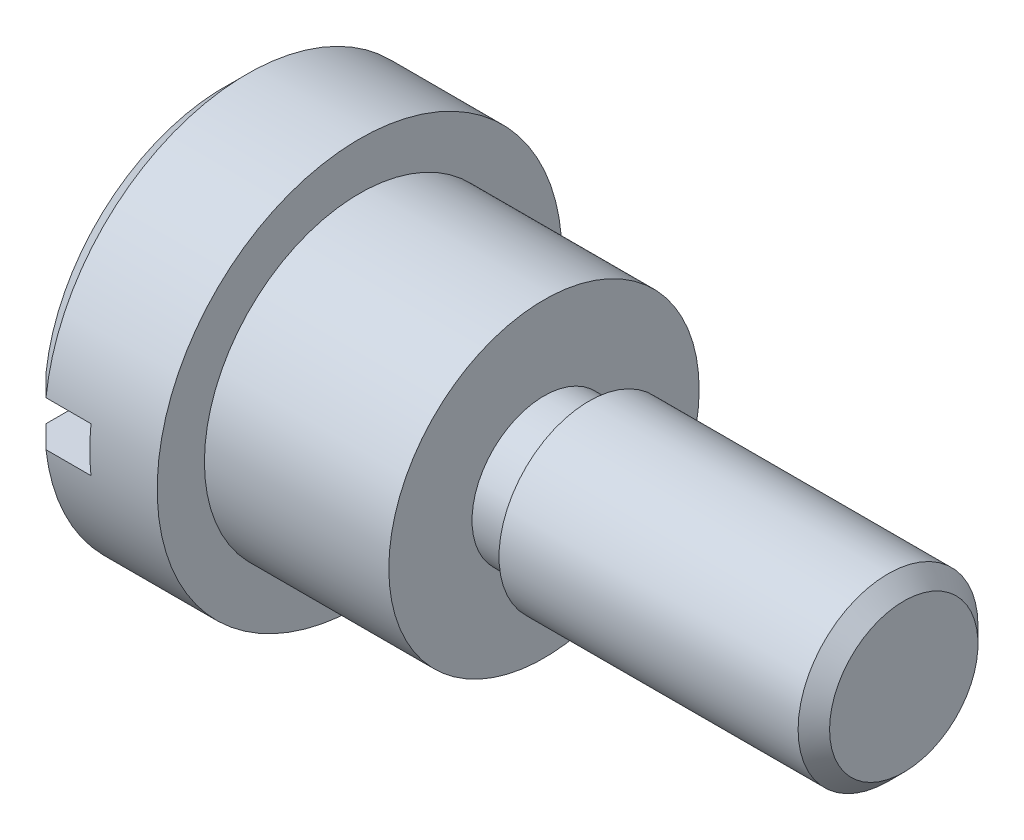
ISO-10303-21;
HEADER;
FILE_DESCRIPTION(('STEP AP214'),'2;1');
FILE_NAME('part.step','',(''),(''),'','','');
FILE_SCHEMA(('AUTOMOTIVE_DESIGN { 1 0 10303 214 1 1 1 1 }'));
ENDSEC;
DATA;
#1=APPLICATION_CONTEXT('core data for automotive mechanical design processes');
#2=APPLICATION_PROTOCOL_DEFINITION('international standard','automotive_design',2000,#1);
#3=PRODUCT_CONTEXT('',#1,'mechanical');
#4=PRODUCT('Part','Part','',(#3));
#5=PRODUCT_RELATED_PRODUCT_CATEGORY('part','',(#4));
#6=PRODUCT_DEFINITION_FORMATION('','',#4);
#7=PRODUCT_DEFINITION_CONTEXT('part definition',#1,'design');
#8=PRODUCT_DEFINITION('design','',#6,#7);
#9=PRODUCT_DEFINITION_SHAPE('','',#8);
#10=(LENGTH_UNIT() NAMED_UNIT(*) SI_UNIT(.MILLI.,.METRE.));
#11=(NAMED_UNIT(*) PLANE_ANGLE_UNIT() SI_UNIT($,.RADIAN.));
#12=(NAMED_UNIT(*) SI_UNIT($,.STERADIAN.) SOLID_ANGLE_UNIT());
#13=UNCERTAINTY_MEASURE_WITH_UNIT(LENGTH_MEASURE(1.E-05),#10,'distance_accuracy_value','');
#14=(GEOMETRIC_REPRESENTATION_CONTEXT(3) GLOBAL_UNCERTAINTY_ASSIGNED_CONTEXT((#13)) GLOBAL_UNIT_ASSIGNED_CONTEXT((#10,
#11,#12)) REPRESENTATION_CONTEXT('',''));
#15=CARTESIAN_POINT('',(0.,0.,0.));
#16=DIRECTION('',(0.,0.,1.));
#17=DIRECTION('',(1.,0.,0.));
#18=AXIS2_PLACEMENT_3D('',#15,#16,#17);
#19=CARTESIAN_POINT('',(15.1,0.825,0.));
#20=DIRECTION('',(1.,0.,0.));
#21=DIRECTION('',(0.,0.,-1.));
#22=AXIS2_PLACEMENT_3D('',#19,#20,#21);
#23=PLANE('',#22);
#24=CARTESIAN_POINT('',(15.1000000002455,0.,0.));
#25=DIRECTION('',(-1.,0.,0.));
#26=DIRECTION('',(0.,0.,1.));
#27=AXIS2_PLACEMENT_3D('',#24,#25,#26);
#28=CIRCLE('',#27,1.65000000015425);
#29=CARTESIAN_POINT('',(15.1000000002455,0.,1.65000000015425));
#30=VERTEX_POINT('',#29);
#31=EDGE_CURVE('E135',#30,#30,#28,.T.);
#32=ORIENTED_EDGE('',*,*,#31,.F.);
#33=EDGE_LOOP('',(#32));
#34=FACE_BOUND('',#33,.T.);
#35=ADVANCED_FACE('F17',(#34),#23,.T.);
#36=CARTESIAN_POINT('',(1.5,0.5,0.));
#37=DIRECTION('',(1.,0.,0.));
#38=DIRECTION('',(0.,0.,-1.));
#39=AXIS2_PLACEMENT_3D('',#36,#37,#38);
#40=PLANE('',#39);
#41=DIRECTION('',(0.,0.,-1.));
#42=VECTOR('',#41,1.);
#43=CARTESIAN_POINT('',(1.5,-0.5,0.));
#44=LINE('',#43,#42);
#45=CARTESIAN_POINT('',(1.5,-0.5,-4.47213595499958));
#46=VERTEX_POINT('',#45);
#47=CARTESIAN_POINT('',(1.5,-0.5,4.47213595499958));
#48=VERTEX_POINT('',#47);
#49=EDGE_CURVE('E211',#46,#48,#44,.F.);
#50=ORIENTED_EDGE('',*,*,#49,.T.);
#51=CARTESIAN_POINT('',(1.5,0.,0.));
#52=DIRECTION('',(1.,0.,0.));
#53=DIRECTION('',(0.,0.,-1.));
#54=AXIS2_PLACEMENT_3D('',#51,#52,#53);
#55=CIRCLE('',#54,4.5);
#56=CARTESIAN_POINT('',(1.5,0.5,4.47213595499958));
#57=VERTEX_POINT('',#56);
#58=EDGE_CURVE('E20',#57,#48,#55,.T.);
#59=ORIENTED_EDGE('',*,*,#58,.F.);
#60=DIRECTION('',(0.,0.,1.));
#61=VECTOR('',#60,1.);
#62=CARTESIAN_POINT('',(1.5,0.5,0.));
#63=LINE('',#62,#61);
#64=CARTESIAN_POINT('',(1.5,0.5,-4.47213595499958));
#65=VERTEX_POINT('',#64);
#66=EDGE_CURVE('E82',#57,#65,#63,.F.);
#67=ORIENTED_EDGE('',*,*,#66,.T.);
#68=CARTESIAN_POINT('',(1.5,0.,0.));
#69=DIRECTION('',(1.,0.,0.));
#70=DIRECTION('',(0.,0.,-1.));
#71=AXIS2_PLACEMENT_3D('',#68,#69,#70);
#72=CIRCLE('',#71,4.5);
#73=EDGE_CURVE('E77',#46,#65,#72,.T.);
#74=ORIENTED_EDGE('',*,*,#73,.F.);
#75=EDGE_LOOP('',(#50,#59,#67,#74));
#76=FACE_BOUND('',#75,.T.);
#77=ADVANCED_FACE('F144',(#76),#40,.F.);
#78=CARTESIAN_POINT('',(14.7499999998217,0.,0.));
#79=DIRECTION('',(-1.,0.,0.));
#80=DIRECTION('',(0.,0.,1.));
#81=AXIS2_PLACEMENT_3D('',#78,#79,#80);
#82=CONICAL_SURFACE('',#81,1.99999999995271,0.785398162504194);
#83=CARTESIAN_POINT('',(14.75,0.,0.));
#84=DIRECTION('',(1.,0.,0.));
#85=DIRECTION('',(0.,0.,-1.));
#86=AXIS2_PLACEMENT_3D('',#83,#84,#85);
#87=CIRCLE('',#86,2.);
#88=CARTESIAN_POINT('',(14.75,0.,-2.));
#89=VERTEX_POINT('',#88);
#90=EDGE_CURVE('E81',#89,#89,#87,.F.);
#91=ORIENTED_EDGE('',*,*,#90,.F.);
#92=EDGE_LOOP('',(#91));
#93=FACE_BOUND('',#92,.T.);
#94=ORIENTED_EDGE('',*,*,#31,.T.);
#95=EDGE_LOOP('',(#94));
#96=FACE_BOUND('',#95,.T.);
#97=ADVANCED_FACE('F140',(#93,#96),#82,.T.);
#98=CARTESIAN_POINT('',(1.5,-0.5,0.));
#99=DIRECTION('',(0.,-1.,0.));
#100=DIRECTION('',(0.,0.,-1.));
#101=AXIS2_PLACEMENT_3D('',#98,#99,#100);
#102=PLANE('',#101);
#103=CARTESIAN_POINT('',(-1.75514523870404E-10,-0.499999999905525,-3.96862696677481));
#104=CARTESIAN_POINT('',(0.0832985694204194,-0.499999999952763,-4.05257965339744));
#105=CARTESIAN_POINT('',(0.166614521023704,-0.499999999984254,-4.13651507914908));
#106=CARTESIAN_POINT('',(0.333281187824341,-0.500000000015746,-4.30435140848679));
#107=CARTESIAN_POINT('',(0.416631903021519,-0.500000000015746,-4.38825231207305));
#108=CARTESIAN_POINT('',(0.500000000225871,-0.5,-4.4721359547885));
#109=B_SPLINE_CURVE_WITH_KNOTS('',3,(#103,#104,#105,#106,#107,#108),.UNSPECIFIED.,.F.,.F.,(4,2,
4),(0.,0.354796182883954,0.709592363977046),.UNSPECIFIED.);
#110=CARTESIAN_POINT('',(-2.32133576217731E-10,-0.5,-3.96862696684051));
#111=VERTEX_POINT('',#110);
#112=CARTESIAN_POINT('',(0.500000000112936,-0.5,-4.47213595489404));
#113=VERTEX_POINT('',#112);
#114=EDGE_CURVE('E95',#111,#113,#109,.T.);
#115=ORIENTED_EDGE('',*,*,#114,.F.);
#116=DIRECTION('',(0.,0.,1.));
#117=VECTOR('',#116,1.);
#118=CARTESIAN_POINT('',(0.,-0.5,0.));
#119=LINE('',#118,#117);
#120=CARTESIAN_POINT('',(-2.32133807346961E-10,-0.5,3.96862696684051));
#121=VERTEX_POINT('',#120);
#122=EDGE_CURVE('E196',#121,#111,#119,.F.);
#123=ORIENTED_EDGE('',*,*,#122,.F.);
#124=CARTESIAN_POINT('',(0.500000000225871,-0.5,4.4721359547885));
#125=CARTESIAN_POINT('',(0.416631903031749,-0.5,4.3882523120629));
#126=CARTESIAN_POINT('',(0.333281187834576,-0.5,4.30435140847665));
#127=CARTESIAN_POINT('',(0.166614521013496,-0.5,4.13651507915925));
#128=CARTESIAN_POINT('',(0.0832985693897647,-0.5,4.05257965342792));
#129=CARTESIAN_POINT('',(-2.36843067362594E-10,-0.5,3.96862696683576));
#130=B_SPLINE_CURVE_WITH_KNOTS('',3,(#124,#125,#126,#127,#128,#129),.UNSPECIFIED.,.F.,.F.,(4,2,
4),(0.,0.354796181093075,0.709592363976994),.UNSPECIFIED.);
#131=CARTESIAN_POINT('',(0.500000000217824,-0.5,4.47213595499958));
#132=VERTEX_POINT('',#131);
#133=EDGE_CURVE('E129',#132,#121,#130,.T.);
#134=ORIENTED_EDGE('',*,*,#133,.F.);
#135=DIRECTION('',(1.,0.,0.));
#136=VECTOR('',#135,1.);
#137=CARTESIAN_POINT('',(1.5,-0.5,4.47213595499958));
#138=LINE('',#137,#136);
#139=EDGE_CURVE('E134',#48,#132,#138,.F.);
#140=ORIENTED_EDGE('',*,*,#139,.F.);
#141=ORIENTED_EDGE('',*,*,#49,.F.);
#142=DIRECTION('',(1.,0.,0.));
#143=VECTOR('',#142,1.);
#144=CARTESIAN_POINT('',(1.5,-0.5,-4.47213595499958));
#145=LINE('',#144,#143);
#146=EDGE_CURVE('E92',#113,#46,#145,.T.);
#147=ORIENTED_EDGE('',*,*,#146,.F.);
#148=EDGE_LOOP('',(#115,#123,#134,#140,#141,#147));
#149=FACE_BOUND('',#148,.T.);
#150=ADVANCED_FACE('F136',(#149),#102,.F.);
#151=CARTESIAN_POINT('',(0.,0.5,0.));
#152=DIRECTION('',(0.,1.,0.));
#153=DIRECTION('',(0.,0.,1.));
#154=AXIS2_PLACEMENT_3D('',#151,#152,#153);
#155=PLANE('',#154);
#156=ORIENTED_EDGE('',*,*,#66,.F.);
#157=DIRECTION('',(1.,0.,0.));
#158=VECTOR('',#157,1.);
#159=CARTESIAN_POINT('',(0.,0.5,4.47213595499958));
#160=LINE('',#159,#158);
#161=CARTESIAN_POINT('',(0.500000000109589,0.5,4.47213595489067));
#162=VERTEX_POINT('',#161);
#163=EDGE_CURVE('E67',#162,#57,#160,.T.);
#164=ORIENTED_EDGE('',*,*,#163,.F.);
#165=CARTESIAN_POINT('',(-1.75514303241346E-10,0.499999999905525,3.96862696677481));
#166=CARTESIAN_POINT('',(0.0832985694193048,0.499999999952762,4.05257965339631));
#167=CARTESIAN_POINT('',(0.166614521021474,0.499999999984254,4.13651507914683));
#168=CARTESIAN_POINT('',(0.33328118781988,0.500000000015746,4.3043514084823));
#169=CARTESIAN_POINT('',(0.416631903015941,0.500000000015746,4.38825231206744));
#170=CARTESIAN_POINT('',(0.500000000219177,0.5,4.47213595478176));
#171=B_SPLINE_CURVE_WITH_KNOTS('',3,(#165,#166,#167,#168,#169,#170),.UNSPECIFIED.,.F.,.F.,(4,2,
4),(0.,0.354796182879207,0.70959236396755),.UNSPECIFIED.);
#172=CARTESIAN_POINT('',(-2.32133555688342E-10,0.5,3.96862696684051));
#173=VERTEX_POINT('',#172);
#174=EDGE_CURVE('E70',#173,#162,#171,.T.);
#175=ORIENTED_EDGE('',*,*,#174,.F.);
#176=DIRECTION('',(0.,0.,1.));
#177=VECTOR('',#176,1.);
#178=CARTESIAN_POINT('',(0.,0.5,0.));
#179=LINE('',#178,#177);
#180=CARTESIAN_POINT('',(-2.32133794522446E-10,0.5,-3.96862696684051));
#181=VERTEX_POINT('',#180);
#182=EDGE_CURVE('E90',#181,#173,#179,.T.);
#183=ORIENTED_EDGE('',*,*,#182,.F.);
#184=CARTESIAN_POINT('',(0.500000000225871,0.5,-4.4721359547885));
#185=CARTESIAN_POINT('',(0.41663190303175,0.5,-4.3882523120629));
#186=CARTESIAN_POINT('',(0.333281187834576,0.5,-4.30435140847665));
#187=CARTESIAN_POINT('',(0.166614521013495,0.5,-4.13651507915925));
#188=CARTESIAN_POINT('',(0.0832985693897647,0.5,-4.05257965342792));
#189=CARTESIAN_POINT('',(-2.36842966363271E-10,0.5,-3.96862696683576));
#190=B_SPLINE_CURVE_WITH_KNOTS('',3,(#184,#185,#186,#187,#188,#189),.UNSPECIFIED.,.F.,.F.,(4,2,
4),(0.,0.354796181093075,0.709592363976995),.UNSPECIFIED.);
#191=CARTESIAN_POINT('',(0.500000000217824,0.5,-4.47213595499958));
#192=VERTEX_POINT('',#191);
#193=EDGE_CURVE('E35',#192,#181,#190,.T.);
#194=ORIENTED_EDGE('',*,*,#193,.F.);
#195=DIRECTION('',(1.,0.,0.));
#196=VECTOR('',#195,1.);
#197=CARTESIAN_POINT('',(0.,0.5,-4.47213595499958));
#198=LINE('',#197,#196);
#199=EDGE_CURVE('E73',#65,#192,#198,.F.);
#200=ORIENTED_EDGE('',*,*,#199,.F.);
#201=EDGE_LOOP('',(#156,#164,#175,#183,#194,#200));
#202=FACE_BOUND('',#201,.T.);
#203=ADVANCED_FACE('F88',(#202),#155,.F.);
#204=CARTESIAN_POINT('',(11.425,0.,0.));
#205=DIRECTION('',(1.,0.,0.));
#206=DIRECTION('',(0.,0.,-1.));
#207=AXIS2_PLACEMENT_3D('',#204,#205,#206);
#208=CYLINDRICAL_SURFACE('',#207,2.);
#209=CARTESIAN_POINT('',(8.1,0.,0.));
#210=DIRECTION('',(1.,0.,0.));
#211=DIRECTION('',(0.,0.,-1.));
#212=AXIS2_PLACEMENT_3D('',#209,#210,#211);
#213=CIRCLE('',#212,2.);
#214=CARTESIAN_POINT('',(8.1,0.,-2.));
#215=VERTEX_POINT('',#214);
#216=EDGE_CURVE('E192',#215,#215,#213,.F.);
#217=ORIENTED_EDGE('',*,*,#216,.F.);
#218=EDGE_LOOP('',(#217));
#219=FACE_BOUND('',#218,.T.);
#220=ORIENTED_EDGE('',*,*,#90,.T.);
#221=EDGE_LOOP('',(#220));
#222=FACE_BOUND('',#221,.T.);
#223=ADVANCED_FACE('F226',(#219,#222),#208,.T.);
#224=CARTESIAN_POINT('',(0.,2.,0.));
#225=DIRECTION('',(-1.,0.,0.));
#226=DIRECTION('',(0.,0.,1.));
#227=AXIS2_PLACEMENT_3D('',#224,#225,#226);
#228=PLANE('',#227);
#229=ORIENTED_EDGE('',*,*,#122,.T.);
#230=CARTESIAN_POINT('',(-2.27373675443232E-10,0.,0.));
#231=DIRECTION('',(1.,0.,0.));
#232=DIRECTION('',(0.,0.,-1.));
#233=AXIS2_PLACEMENT_3D('',#230,#231,#232);
#234=CIRCLE('',#233,4.00000000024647);
#235=EDGE_CURVE('E190',#121,#111,#234,.T.);
#236=ORIENTED_EDGE('',*,*,#235,.F.);
#237=EDGE_LOOP('',(#229,#236));
#238=FACE_BOUND('',#237,.T.);
#239=ADVANCED_FACE('F223',(#238),#228,.T.);
#240=CARTESIAN_POINT('',(0.,2.,0.));
#241=DIRECTION('',(-1.,0.,0.));
#242=DIRECTION('',(0.,0.,1.));
#243=AXIS2_PLACEMENT_3D('',#240,#241,#242);
#244=PLANE('',#243);
#245=ORIENTED_EDGE('',*,*,#182,.T.);
#246=CARTESIAN_POINT('',(-2.27373675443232E-10,0.,0.));
#247=DIRECTION('',(1.,0.,0.));
#248=DIRECTION('',(0.,0.,-1.));
#249=AXIS2_PLACEMENT_3D('',#246,#247,#248);
#250=CIRCLE('',#249,4.00000000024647);
#251=EDGE_CURVE('E188',#181,#173,#250,.T.);
#252=ORIENTED_EDGE('',*,*,#251,.F.);
#253=EDGE_LOOP('',(#245,#252));
#254=FACE_BOUND('',#253,.T.);
#255=ADVANCED_FACE('F225',(#254),#244,.T.);
#256=CARTESIAN_POINT('',(8.1,1.8,0.));
#257=DIRECTION('',(-1.,0.,0.));
#258=DIRECTION('',(0.,0.,1.));
#259=AXIS2_PLACEMENT_3D('',#256,#257,#258);
#260=PLANE('',#259);
#261=CARTESIAN_POINT('',(8.1,0.,0.));
#262=DIRECTION('',(1.,0.,0.));
#263=DIRECTION('',(0.,0.,-1.));
#264=AXIS2_PLACEMENT_3D('',#261,#262,#263);
#265=CIRCLE('',#264,1.6);
#266=CARTESIAN_POINT('',(8.1,0.,-1.6));
#267=VERTEX_POINT('',#266);
#268=EDGE_CURVE('E185',#267,#267,#265,.F.);
#269=ORIENTED_EDGE('',*,*,#268,.F.);
#270=EDGE_LOOP('',(#269));
#271=FACE_BOUND('',#270,.T.);
#272=ORIENTED_EDGE('',*,*,#216,.T.);
#273=EDGE_LOOP('',(#272));
#274=FACE_BOUND('',#273,.T.);
#275=ADVANCED_FACE('F125',(#271,#274),#260,.T.);
#276=CARTESIAN_POINT('',(0.50000000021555,0.,0.));
#277=DIRECTION('',(1.,0.,0.));
#278=DIRECTION('',(0.,0.,-1.));
#279=AXIS2_PLACEMENT_3D('',#276,#277,#278);
#280=CONICAL_SURFACE('',#279,4.4999999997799,0.785398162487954);
#281=ORIENTED_EDGE('',*,*,#133,.T.);
#282=ORIENTED_EDGE('',*,*,#235,.T.);
#283=ORIENTED_EDGE('',*,*,#114,.T.);
#284=CARTESIAN_POINT('',(0.5,0.,0.));
#285=DIRECTION('',(1.,0.,0.));
#286=DIRECTION('',(0.,0.,-1.));
#287=AXIS2_PLACEMENT_3D('',#284,#285,#286);
#288=CIRCLE('',#287,4.5);
#289=EDGE_CURVE('E86',#132,#113,#288,.T.);
#290=ORIENTED_EDGE('',*,*,#289,.F.);
#291=EDGE_LOOP('',(#281,#282,#283,#290));
#292=FACE_BOUND('',#291,.T.);
#293=ADVANCED_FACE('F119',(#292),#280,.T.);
#294=CARTESIAN_POINT('',(0.50000000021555,0.,0.));
#295=DIRECTION('',(1.,0.,0.));
#296=DIRECTION('',(0.,0.,-1.));
#297=AXIS2_PLACEMENT_3D('',#294,#295,#296);
#298=CONICAL_SURFACE('',#297,4.4999999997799,0.785398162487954);
#299=ORIENTED_EDGE('',*,*,#193,.T.);
#300=ORIENTED_EDGE('',*,*,#251,.T.);
#301=ORIENTED_EDGE('',*,*,#174,.T.);
#302=CARTESIAN_POINT('',(0.5,0.,0.));
#303=DIRECTION('',(1.,0.,0.));
#304=DIRECTION('',(0.,0.,-1.));
#305=AXIS2_PLACEMENT_3D('',#302,#303,#304);
#306=CIRCLE('',#305,4.5);
#307=EDGE_CURVE('E75',#192,#162,#306,.T.);
#308=ORIENTED_EDGE('',*,*,#307,.F.);
#309=EDGE_LOOP('',(#299,#300,#301,#308));
#310=FACE_BOUND('',#309,.T.);
#311=ADVANCED_FACE('F84',(#310),#298,.T.);
#312=CARTESIAN_POINT('',(7.6,0.,0.));
#313=DIRECTION('',(1.,0.,0.));
#314=DIRECTION('',(0.,0.,-1.));
#315=AXIS2_PLACEMENT_3D('',#312,#313,#314);
#316=CYLINDRICAL_SURFACE('',#315,1.6);
#317=CARTESIAN_POINT('',(7.1,0.,0.));
#318=DIRECTION('',(1.,0.,0.));
#319=DIRECTION('',(0.,0.,-1.));
#320=AXIS2_PLACEMENT_3D('',#317,#318,#319);
#321=CIRCLE('',#320,1.6);
#322=CARTESIAN_POINT('',(7.1,0.,-1.6));
#323=VERTEX_POINT('',#322);
#324=EDGE_CURVE('E85',#323,#323,#321,.F.);
#325=ORIENTED_EDGE('',*,*,#324,.F.);
#326=EDGE_LOOP('',(#325));
#327=FACE_BOUND('',#326,.T.);
#328=ORIENTED_EDGE('',*,*,#268,.T.);
#329=EDGE_LOOP('',(#328));
#330=FACE_BOUND('',#329,.T.);
#331=ADVANCED_FACE('F118',(#327,#330),#316,.T.);
#332=CARTESIAN_POINT('',(1.75,0.,0.));
#333=DIRECTION('',(1.,0.,0.));
#334=DIRECTION('',(0.,0.,-1.));
#335=AXIS2_PLACEMENT_3D('',#332,#333,#334);
#336=CYLINDRICAL_SURFACE('',#335,4.5);
#337=CARTESIAN_POINT('',(3.,0.,0.));
#338=DIRECTION('',(1.,0.,0.));
#339=DIRECTION('',(0.,0.,-1.));
#340=AXIS2_PLACEMENT_3D('',#337,#338,#339);
#341=CIRCLE('',#340,4.5);
#342=CARTESIAN_POINT('',(3.,0.,-4.5));
#343=VERTEX_POINT('',#342);
#344=EDGE_CURVE('E177',#343,#343,#341,.T.);
#345=ORIENTED_EDGE('',*,*,#344,.F.);
#346=EDGE_LOOP('',(#345));
#347=FACE_BOUND('',#346,.T.);
#348=ORIENTED_EDGE('',*,*,#199,.T.);
#349=ORIENTED_EDGE('',*,*,#307,.T.);
#350=ORIENTED_EDGE('',*,*,#163,.T.);
#351=ORIENTED_EDGE('',*,*,#58,.T.);
#352=ORIENTED_EDGE('',*,*,#139,.T.);
#353=ORIENTED_EDGE('',*,*,#289,.T.);
#354=ORIENTED_EDGE('',*,*,#146,.T.);
#355=ORIENTED_EDGE('',*,*,#73,.T.);
#356=EDGE_LOOP('',(#348,#349,#350,#351,#352,#353,#354,#355));
#357=FACE_BOUND('',#356,.T.);
#358=ADVANCED_FACE('F74',(#347,#357),#336,.T.);
#359=CARTESIAN_POINT('',(7.1,2.525,0.));
#360=DIRECTION('',(1.,0.,0.));
#361=DIRECTION('',(0.,0.,-1.));
#362=AXIS2_PLACEMENT_3D('',#359,#360,#361);
#363=PLANE('',#362);
#364=ORIENTED_EDGE('',*,*,#324,.T.);
#365=EDGE_LOOP('',(#364));
#366=FACE_BOUND('',#365,.T.);
#367=CARTESIAN_POINT('',(7.1,0.,0.));
#368=DIRECTION('',(1.,0.,0.));
#369=DIRECTION('',(0.,0.,-1.));
#370=AXIS2_PLACEMENT_3D('',#367,#368,#369);
#371=CIRCLE('',#370,3.45);
#372=CARTESIAN_POINT('',(7.1,0.,-3.45));
#373=VERTEX_POINT('',#372);
#374=EDGE_CURVE('E26',#373,#373,#371,.F.);
#375=ORIENTED_EDGE('',*,*,#374,.F.);
#376=EDGE_LOOP('',(#375));
#377=FACE_BOUND('',#376,.T.);
#378=ADVANCED_FACE('F162',(#366,#377),#363,.T.);
#379=CARTESIAN_POINT('',(3.,3.975,0.));
#380=DIRECTION('',(1.,0.,0.));
#381=DIRECTION('',(0.,0.,-1.));
#382=AXIS2_PLACEMENT_3D('',#379,#380,#381);
#383=PLANE('',#382);
#384=CARTESIAN_POINT('',(3.,0.,0.));
#385=DIRECTION('',(1.,0.,0.));
#386=DIRECTION('',(0.,0.,-1.));
#387=AXIS2_PLACEMENT_3D('',#384,#385,#386);
#388=CIRCLE('',#387,3.45);
#389=CARTESIAN_POINT('',(3.,0.,-3.45));
#390=VERTEX_POINT('',#389);
#391=EDGE_CURVE('E11',#390,#390,#388,.T.);
#392=ORIENTED_EDGE('',*,*,#391,.F.);
#393=EDGE_LOOP('',(#392));
#394=FACE_BOUND('',#393,.T.);
#395=ORIENTED_EDGE('',*,*,#344,.T.);
#396=EDGE_LOOP('',(#395));
#397=FACE_BOUND('',#396,.T.);
#398=ADVANCED_FACE('F156',(#394,#397),#383,.T.);
#399=CARTESIAN_POINT('',(5.05,0.,0.));
#400=DIRECTION('',(1.,0.,0.));
#401=DIRECTION('',(0.,0.,-1.));
#402=AXIS2_PLACEMENT_3D('',#399,#400,#401);
#403=CYLINDRICAL_SURFACE('',#402,3.45);
#404=ORIENTED_EDGE('',*,*,#391,.T.);
#405=EDGE_LOOP('',(#404));
#406=FACE_BOUND('',#405,.T.);
#407=ORIENTED_EDGE('',*,*,#374,.T.);
#408=EDGE_LOOP('',(#407));
#409=FACE_BOUND('',#408,.T.);
#410=ADVANCED_FACE('F154',(#406,#409),#403,.T.);
#411=CLOSED_SHELL('',(#35,#77,#97,#150,#203,#223,#239,#255,#275,#293,#311,#331,#358,#378,#398,#410));
#412=MANIFOLD_SOLID_BREP('B1',#411);
#413=ADVANCED_BREP_SHAPE_REPRESENTATION('',(#18,#412),#14);
#414=SHAPE_DEFINITION_REPRESENTATION(#9,#413);
ENDSEC;
END-ISO-10303-21;
